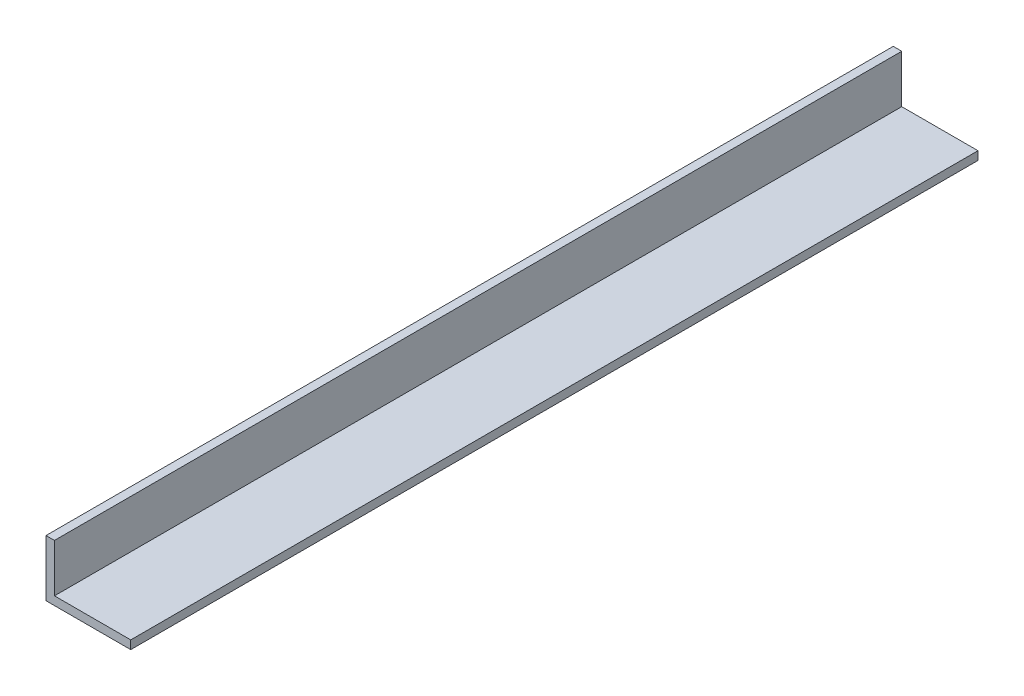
ISO-10303-21;
HEADER;
FILE_DESCRIPTION(('STEP AP214'),'2;1');
FILE_NAME('part.step','',(''),(''),'','','');
FILE_SCHEMA(('AUTOMOTIVE_DESIGN { 1 0 10303 214 1 1 1 1 }'));
ENDSEC;
DATA;
#1=APPLICATION_CONTEXT('core data for automotive mechanical design processes');
#2=APPLICATION_PROTOCOL_DEFINITION('international standard','automotive_design',2000,#1);
#3=PRODUCT_CONTEXT('',#1,'mechanical');
#4=PRODUCT('Part','Part','',(#3));
#5=PRODUCT_RELATED_PRODUCT_CATEGORY('part','',(#4));
#6=PRODUCT_DEFINITION_FORMATION('','',#4);
#7=PRODUCT_DEFINITION_CONTEXT('part definition',#1,'design');
#8=PRODUCT_DEFINITION('design','',#6,#7);
#9=PRODUCT_DEFINITION_SHAPE('','',#8);
#10=(LENGTH_UNIT() NAMED_UNIT(*) SI_UNIT(.MILLI.,.METRE.));
#11=(NAMED_UNIT(*) PLANE_ANGLE_UNIT() SI_UNIT($,.RADIAN.));
#12=(NAMED_UNIT(*) SI_UNIT($,.STERADIAN.) SOLID_ANGLE_UNIT());
#13=UNCERTAINTY_MEASURE_WITH_UNIT(LENGTH_MEASURE(1.E-05),#10,'distance_accuracy_value','');
#14=(GEOMETRIC_REPRESENTATION_CONTEXT(3) GLOBAL_UNCERTAINTY_ASSIGNED_CONTEXT((#13)) GLOBAL_UNIT_ASSIGNED_CONTEXT((#10,
#11,#12)) REPRESENTATION_CONTEXT('',''));
#15=CARTESIAN_POINT('',(0.,0.,0.));
#16=DIRECTION('',(0.,0.,1.));
#17=DIRECTION('',(1.,0.,0.));
#18=AXIS2_PLACEMENT_3D('',#15,#16,#17);
#19=CARTESIAN_POINT('',(27.,0.,150.));
#20=DIRECTION('',(0.,-1.,0.));
#21=DIRECTION('',(1.,0.,0.));
#22=AXIS2_PLACEMENT_3D('',#19,#20,#21);
#23=PLANE('',#22);
#24=DIRECTION('',(-1.,0.,0.));
#25=VECTOR('',#24,1.);
#26=CARTESIAN_POINT('',(27.,0.,-150.));
#27=LINE('',#26,#25);
#28=CARTESIAN_POINT('',(27.,0.,-150.));
#29=VERTEX_POINT('',#28);
#30=CARTESIAN_POINT('',(0.,0.,-150.));
#31=VERTEX_POINT('',#30);
#32=EDGE_CURVE('E120',#29,#31,#27,.T.);
#33=ORIENTED_EDGE('',*,*,#32,.T.);
#34=DIRECTION('',(0.,0.,-1.));
#35=VECTOR('',#34,1.);
#36=CARTESIAN_POINT('',(0.,0.,150.));
#37=LINE('',#36,#35);
#38=CARTESIAN_POINT('',(0.,0.,150.));
#39=VERTEX_POINT('',#38);
#40=EDGE_CURVE('E11',#39,#31,#37,.T.);
#41=ORIENTED_EDGE('',*,*,#40,.F.);
#42=DIRECTION('',(-1.,0.,0.));
#43=VECTOR('',#42,1.);
#44=CARTESIAN_POINT('',(27.,0.,150.));
#45=LINE('',#44,#43);
#46=CARTESIAN_POINT('',(27.,0.,150.));
#47=VERTEX_POINT('',#46);
#48=EDGE_CURVE('E130',#47,#39,#45,.T.);
#49=ORIENTED_EDGE('',*,*,#48,.F.);
#50=DIRECTION('',(0.,0.,-1.));
#51=VECTOR('',#50,1.);
#52=CARTESIAN_POINT('',(27.,0.,150.));
#53=LINE('',#52,#51);
#54=EDGE_CURVE('E116',#47,#29,#53,.T.);
#55=ORIENTED_EDGE('',*,*,#54,.T.);
#56=EDGE_LOOP('',(#33,#41,#49,#55));
#57=FACE_BOUND('',#56,.T.);
#58=ADVANCED_FACE('F36',(#57),#23,.F.);
#59=CARTESIAN_POINT('',(0.,0.,150.));
#60=DIRECTION('',(-1.,0.,0.));
#61=DIRECTION('',(0.,0.,1.));
#62=AXIS2_PLACEMENT_3D('',#59,#60,#61);
#63=PLANE('',#62);
#64=DIRECTION('',(0.,1.,0.));
#65=VECTOR('',#64,1.);
#66=CARTESIAN_POINT('',(0.,0.,-150.));
#67=LINE('',#66,#65);
#68=CARTESIAN_POINT('',(0.,17.,-150.));
#69=VERTEX_POINT('',#68);
#70=EDGE_CURVE('E123',#31,#69,#67,.T.);
#71=ORIENTED_EDGE('',*,*,#70,.T.);
#72=DIRECTION('',(0.,0.,-1.));
#73=VECTOR('',#72,1.);
#74=CARTESIAN_POINT('',(0.,17.,150.));
#75=LINE('',#74,#73);
#76=CARTESIAN_POINT('',(0.,17.,150.));
#77=VERTEX_POINT('',#76);
#78=EDGE_CURVE('E44',#77,#69,#75,.T.);
#79=ORIENTED_EDGE('',*,*,#78,.F.);
#80=DIRECTION('',(0.,1.,0.));
#81=VECTOR('',#80,1.);
#82=CARTESIAN_POINT('',(0.,0.,150.));
#83=LINE('',#82,#81);
#84=EDGE_CURVE('E89',#39,#77,#83,.T.);
#85=ORIENTED_EDGE('',*,*,#84,.F.);
#86=ORIENTED_EDGE('',*,*,#40,.T.);
#87=EDGE_LOOP('',(#71,#79,#85,#86));
#88=FACE_BOUND('',#87,.T.);
#89=ADVANCED_FACE('F154',(#88),#63,.F.);
#90=CARTESIAN_POINT('',(0.,17.,150.));
#91=DIRECTION('',(0.,-1.,0.));
#92=DIRECTION('',(0.,0.,-1.));
#93=AXIS2_PLACEMENT_3D('',#90,#91,#92);
#94=PLANE('',#93);
#95=DIRECTION('',(-1.,0.,0.));
#96=VECTOR('',#95,1.);
#97=CARTESIAN_POINT('',(0.,17.,-150.));
#98=LINE('',#97,#96);
#99=CARTESIAN_POINT('',(-3.,17.,-150.));
#100=VERTEX_POINT('',#99);
#101=EDGE_CURVE('E125',#69,#100,#98,.T.);
#102=ORIENTED_EDGE('',*,*,#101,.T.);
#103=DIRECTION('',(0.,0.,-1.));
#104=VECTOR('',#103,1.);
#105=CARTESIAN_POINT('',(-3.,17.,150.));
#106=LINE('',#105,#104);
#107=CARTESIAN_POINT('',(-3.,17.,150.));
#108=VERTEX_POINT('',#107);
#109=EDGE_CURVE('E111',#108,#100,#106,.T.);
#110=ORIENTED_EDGE('',*,*,#109,.F.);
#111=DIRECTION('',(-1.,0.,0.));
#112=VECTOR('',#111,1.);
#113=CARTESIAN_POINT('',(0.,17.,150.));
#114=LINE('',#113,#112);
#115=EDGE_CURVE('E102',#77,#108,#114,.T.);
#116=ORIENTED_EDGE('',*,*,#115,.F.);
#117=ORIENTED_EDGE('',*,*,#78,.T.);
#118=EDGE_LOOP('',(#102,#110,#116,#117));
#119=FACE_BOUND('',#118,.T.);
#120=ADVANCED_FACE('F136',(#119),#94,.F.);
#121=CARTESIAN_POINT('',(-3.,17.,150.));
#122=DIRECTION('',(1.,0.,0.));
#123=DIRECTION('',(0.,1.,0.));
#124=AXIS2_PLACEMENT_3D('',#121,#122,#123);
#125=PLANE('',#124);
#126=DIRECTION('',(0.,-1.,0.));
#127=VECTOR('',#126,1.);
#128=CARTESIAN_POINT('',(-3.,17.,-150.));
#129=LINE('',#128,#127);
#130=CARTESIAN_POINT('',(-3.,-3.,-150.));
#131=VERTEX_POINT('',#130);
#132=EDGE_CURVE('E110',#100,#131,#129,.T.);
#133=ORIENTED_EDGE('',*,*,#132,.T.);
#134=DIRECTION('',(0.,0.,-1.));
#135=VECTOR('',#134,1.);
#136=CARTESIAN_POINT('',(-3.,-3.,150.));
#137=LINE('',#136,#135);
#138=CARTESIAN_POINT('',(-3.,-3.,150.));
#139=VERTEX_POINT('',#138);
#140=EDGE_CURVE('E107',#139,#131,#137,.T.);
#141=ORIENTED_EDGE('',*,*,#140,.F.);
#142=DIRECTION('',(0.,-1.,0.));
#143=VECTOR('',#142,1.);
#144=CARTESIAN_POINT('',(-3.,17.,150.));
#145=LINE('',#144,#143);
#146=EDGE_CURVE('E96',#108,#139,#145,.T.);
#147=ORIENTED_EDGE('',*,*,#146,.F.);
#148=ORIENTED_EDGE('',*,*,#109,.T.);
#149=EDGE_LOOP('',(#133,#141,#147,#148));
#150=FACE_BOUND('',#149,.T.);
#151=ADVANCED_FACE('F108',(#150),#125,.F.);
#152=CARTESIAN_POINT('',(-3.,-3.,150.));
#153=DIRECTION('',(0.,1.,0.));
#154=DIRECTION('',(-1.,0.,0.));
#155=AXIS2_PLACEMENT_3D('',#152,#153,#154);
#156=PLANE('',#155);
#157=DIRECTION('',(1.,0.,0.));
#158=VECTOR('',#157,1.);
#159=CARTESIAN_POINT('',(-3.,-3.,-150.));
#160=LINE('',#159,#158);
#161=CARTESIAN_POINT('',(27.,-3.,-150.));
#162=VERTEX_POINT('',#161);
#163=EDGE_CURVE('E75',#131,#162,#160,.T.);
#164=ORIENTED_EDGE('',*,*,#163,.T.);
#165=DIRECTION('',(0.,0.,-1.));
#166=VECTOR('',#165,1.);
#167=CARTESIAN_POINT('',(27.,-3.,150.));
#168=LINE('',#167,#166);
#169=CARTESIAN_POINT('',(27.,-3.,150.));
#170=VERTEX_POINT('',#169);
#171=EDGE_CURVE('E112',#170,#162,#168,.T.);
#172=ORIENTED_EDGE('',*,*,#171,.F.);
#173=DIRECTION('',(1.,0.,0.));
#174=VECTOR('',#173,1.);
#175=CARTESIAN_POINT('',(-3.,-3.,150.));
#176=LINE('',#175,#174);
#177=EDGE_CURVE('E100',#139,#170,#176,.T.);
#178=ORIENTED_EDGE('',*,*,#177,.F.);
#179=ORIENTED_EDGE('',*,*,#140,.T.);
#180=EDGE_LOOP('',(#164,#172,#178,#179));
#181=FACE_BOUND('',#180,.T.);
#182=ADVANCED_FACE('F114',(#181),#156,.F.);
#183=CARTESIAN_POINT('',(27.,-3.,150.));
#184=DIRECTION('',(-1.,0.,0.));
#185=DIRECTION('',(0.,0.,1.));
#186=AXIS2_PLACEMENT_3D('',#183,#184,#185);
#187=PLANE('',#186);
#188=DIRECTION('',(0.,1.,0.));
#189=VECTOR('',#188,1.);
#190=CARTESIAN_POINT('',(27.,-3.,-150.));
#191=LINE('',#190,#189);
#192=EDGE_CURVE('E81',#162,#29,#191,.T.);
#193=ORIENTED_EDGE('',*,*,#192,.T.);
#194=ORIENTED_EDGE('',*,*,#54,.F.);
#195=DIRECTION('',(0.,1.,0.));
#196=VECTOR('',#195,1.);
#197=CARTESIAN_POINT('',(27.,-3.,150.));
#198=LINE('',#197,#196);
#199=EDGE_CURVE('E52',#170,#47,#198,.T.);
#200=ORIENTED_EDGE('',*,*,#199,.F.);
#201=ORIENTED_EDGE('',*,*,#171,.T.);
#202=EDGE_LOOP('',(#193,#194,#200,#201));
#203=FACE_BOUND('',#202,.T.);
#204=ADVANCED_FACE('F143',(#203),#187,.F.);
#205=CARTESIAN_POINT('',(0.,0.,150.));
#206=DIRECTION('',(0.,0.,-1.));
#207=DIRECTION('',(-1.,0.,0.));
#208=AXIS2_PLACEMENT_3D('',#205,#206,#207);
#209=PLANE('',#208);
#210=ORIENTED_EDGE('',*,*,#48,.T.);
#211=ORIENTED_EDGE('',*,*,#84,.T.);
#212=ORIENTED_EDGE('',*,*,#115,.T.);
#213=ORIENTED_EDGE('',*,*,#146,.T.);
#214=ORIENTED_EDGE('',*,*,#177,.T.);
#215=ORIENTED_EDGE('',*,*,#199,.T.);
#216=EDGE_LOOP('',(#210,#211,#212,#213,#214,#215));
#217=FACE_BOUND('',#216,.T.);
#218=ADVANCED_FACE('F98',(#217),#209,.F.);
#219=CARTESIAN_POINT('',(0.,0.,-150.));
#220=DIRECTION('',(0.,0.,-1.));
#221=DIRECTION('',(-1.,0.,0.));
#222=AXIS2_PLACEMENT_3D('',#219,#220,#221);
#223=PLANE('',#222);
#224=ORIENTED_EDGE('',*,*,#32,.F.);
#225=ORIENTED_EDGE('',*,*,#192,.F.);
#226=ORIENTED_EDGE('',*,*,#163,.F.);
#227=ORIENTED_EDGE('',*,*,#132,.F.);
#228=ORIENTED_EDGE('',*,*,#101,.F.);
#229=ORIENTED_EDGE('',*,*,#70,.F.);
#230=EDGE_LOOP('',(#224,#225,#226,#227,#228,#229));
#231=FACE_BOUND('',#230,.T.);
#232=ADVANCED_FACE('F139',(#231),#223,.T.);
#233=CLOSED_SHELL('',(#58,#89,#120,#151,#182,#204,#218,#232));
#234=MANIFOLD_SOLID_BREP('B2',#233);
#235=ADVANCED_BREP_SHAPE_REPRESENTATION('',(#18,#234),#14);
#236=SHAPE_DEFINITION_REPRESENTATION(#9,#235);
ENDSEC;
END-ISO-10303-21;
